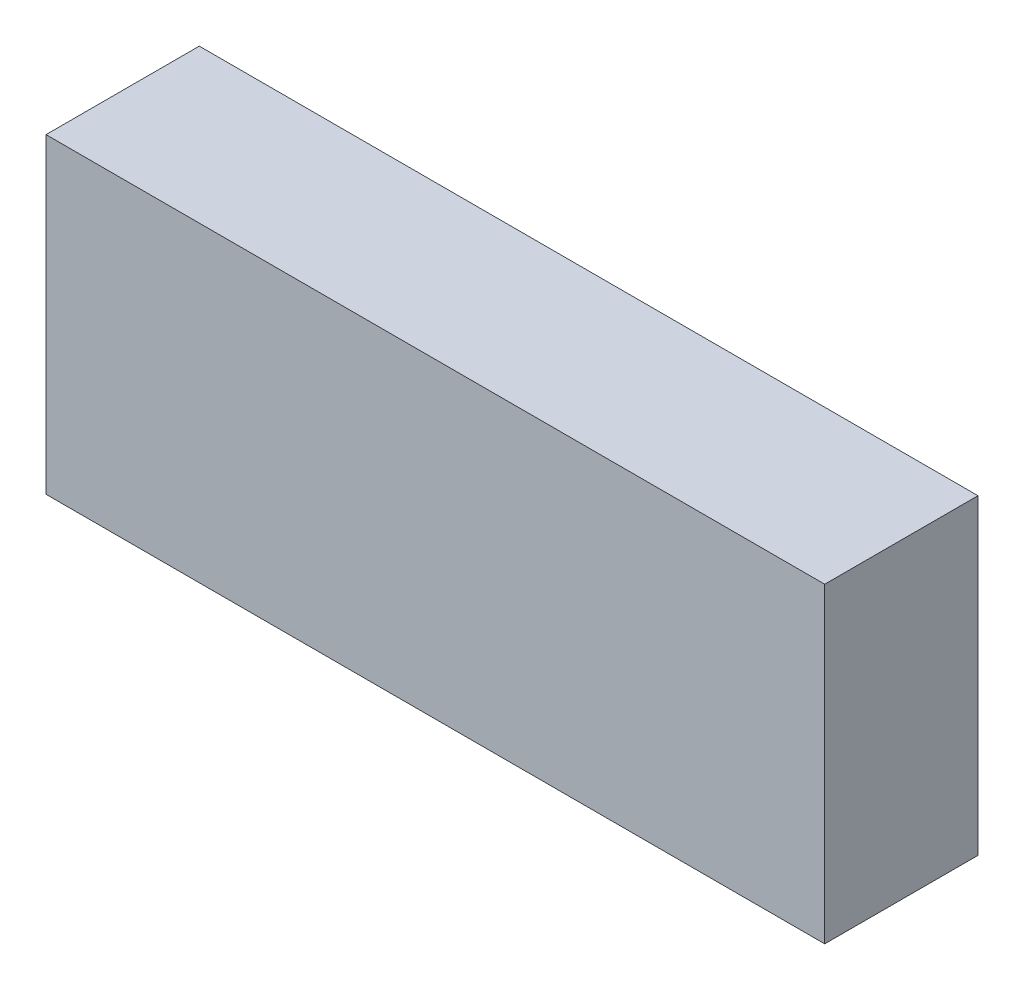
ISO-10303-21;
HEADER;
FILE_DESCRIPTION(('STEP AP214'),'2;1');
FILE_NAME('part.step','',(''),(''),'','','');
FILE_SCHEMA(('AUTOMOTIVE_DESIGN { 1 0 10303 214 1 1 1 1 }'));
ENDSEC;
DATA;
#1=APPLICATION_CONTEXT('core data for automotive mechanical design processes');
#2=APPLICATION_PROTOCOL_DEFINITION('international standard','automotive_design',2000,#1);
#3=PRODUCT_CONTEXT('',#1,'mechanical');
#4=PRODUCT('Part','Part','',(#3));
#5=PRODUCT_RELATED_PRODUCT_CATEGORY('part','',(#4));
#6=PRODUCT_DEFINITION_FORMATION('','',#4);
#7=PRODUCT_DEFINITION_CONTEXT('part definition',#1,'design');
#8=PRODUCT_DEFINITION('design','',#6,#7);
#9=PRODUCT_DEFINITION_SHAPE('','',#8);
#10=(LENGTH_UNIT() NAMED_UNIT(*) SI_UNIT(.MILLI.,.METRE.));
#11=(NAMED_UNIT(*) PLANE_ANGLE_UNIT() SI_UNIT($,.RADIAN.));
#12=(NAMED_UNIT(*) SI_UNIT($,.STERADIAN.) SOLID_ANGLE_UNIT());
#13=UNCERTAINTY_MEASURE_WITH_UNIT(LENGTH_MEASURE(1.E-05),#10,'distance_accuracy_value','');
#14=(GEOMETRIC_REPRESENTATION_CONTEXT(3) GLOBAL_UNCERTAINTY_ASSIGNED_CONTEXT((#13)) GLOBAL_UNIT_ASSIGNED_CONTEXT((#10,
#11,#12)) REPRESENTATION_CONTEXT('',''));
#15=CARTESIAN_POINT('',(0.,0.,0.));
#16=DIRECTION('',(0.,0.,1.));
#17=DIRECTION('',(1.,0.,0.));
#18=AXIS2_PLACEMENT_3D('',#15,#16,#17);
#19=CARTESIAN_POINT('',(0.,0.,0.499999));
#20=DIRECTION('',(0.,0.,1.));
#21=DIRECTION('',(1.,0.,0.));
#22=AXIS2_PLACEMENT_3D('',#19,#20,#21);
#23=PLANE('',#22);
#24=DIRECTION('',(-1.,0.,0.));
#25=VECTOR('',#24,1.);
#26=CARTESIAN_POINT('',(1.27,0.508,0.499999));
#27=LINE('',#26,#25);
#28=CARTESIAN_POINT('',(1.27,0.508,0.499999));
#29=VERTEX_POINT('',#28);
#30=CARTESIAN_POINT('',(-1.27,0.508,0.499999));
#31=VERTEX_POINT('',#30);
#32=EDGE_CURVE('E83',#29,#31,#27,.T.);
#33=ORIENTED_EDGE('',*,*,#32,.T.);
#34=DIRECTION('',(0.,-1.,0.));
#35=VECTOR('',#34,1.);
#36=CARTESIAN_POINT('',(-1.27,0.508,0.499999));
#37=LINE('',#36,#35);
#38=CARTESIAN_POINT('',(-1.27,-0.508,0.499999));
#39=VERTEX_POINT('',#38);
#40=EDGE_CURVE('E110',#31,#39,#37,.T.);
#41=ORIENTED_EDGE('',*,*,#40,.T.);
#42=DIRECTION('',(1.,0.,0.));
#43=VECTOR('',#42,1.);
#44=CARTESIAN_POINT('',(-1.27,-0.508,0.499999));
#45=LINE('',#44,#43);
#46=CARTESIAN_POINT('',(1.27,-0.508,0.499999));
#47=VERTEX_POINT('',#46);
#48=EDGE_CURVE('E75',#39,#47,#45,.T.);
#49=ORIENTED_EDGE('',*,*,#48,.T.);
#50=DIRECTION('',(0.,1.,0.));
#51=VECTOR('',#50,1.);
#52=CARTESIAN_POINT('',(1.27,-0.508,0.499999));
#53=LINE('',#52,#51);
#54=EDGE_CURVE('E11',#47,#29,#53,.T.);
#55=ORIENTED_EDGE('',*,*,#54,.T.);
#56=EDGE_LOOP('',(#33,#41,#49,#55));
#57=FACE_BOUND('',#56,.T.);
#58=ADVANCED_FACE('F17',(#57),#23,.T.);
#59=CARTESIAN_POINT('',(0.,0.,0.));
#60=DIRECTION('',(0.,0.,1.));
#61=DIRECTION('',(1.,0.,0.));
#62=AXIS2_PLACEMENT_3D('',#59,#60,#61);
#63=PLANE('',#62);
#64=DIRECTION('',(0.,1.,0.));
#65=VECTOR('',#64,1.);
#66=CARTESIAN_POINT('',(1.27,-0.508,0.));
#67=LINE('',#66,#65);
#68=CARTESIAN_POINT('',(1.27,-0.508,0.));
#69=VERTEX_POINT('',#68);
#70=CARTESIAN_POINT('',(1.27,0.508,0.));
#71=VERTEX_POINT('',#70);
#72=EDGE_CURVE('E26',#69,#71,#67,.T.);
#73=ORIENTED_EDGE('',*,*,#72,.F.);
#74=DIRECTION('',(1.,0.,0.));
#75=VECTOR('',#74,1.);
#76=CARTESIAN_POINT('',(-1.27,-0.508,0.));
#77=LINE('',#76,#75);
#78=CARTESIAN_POINT('',(-1.27,-0.508,0.));
#79=VERTEX_POINT('',#78);
#80=EDGE_CURVE('E100',#79,#69,#77,.T.);
#81=ORIENTED_EDGE('',*,*,#80,.F.);
#82=DIRECTION('',(0.,-1.,0.));
#83=VECTOR('',#82,1.);
#84=CARTESIAN_POINT('',(-1.27,0.508,0.));
#85=LINE('',#84,#83);
#86=CARTESIAN_POINT('',(-1.27,0.508,0.));
#87=VERTEX_POINT('',#86);
#88=EDGE_CURVE('E85',#87,#79,#85,.T.);
#89=ORIENTED_EDGE('',*,*,#88,.F.);
#90=DIRECTION('',(-1.,0.,0.));
#91=VECTOR('',#90,1.);
#92=CARTESIAN_POINT('',(1.27,0.508,0.));
#93=LINE('',#92,#91);
#94=EDGE_CURVE('E81',#71,#87,#93,.T.);
#95=ORIENTED_EDGE('',*,*,#94,.F.);
#96=EDGE_LOOP('',(#73,#81,#89,#95));
#97=FACE_BOUND('',#96,.T.);
#98=ADVANCED_FACE('F87',(#97),#63,.F.);
#99=CARTESIAN_POINT('',(1.27,-0.508,0.));
#100=DIRECTION('',(-1.,0.,0.));
#101=DIRECTION('',(0.,0.,1.));
#102=AXIS2_PLACEMENT_3D('',#99,#100,#101);
#103=PLANE('',#102);
#104=ORIENTED_EDGE('',*,*,#72,.T.);
#105=DIRECTION('',(0.,0.,1.));
#106=VECTOR('',#105,1.);
#107=CARTESIAN_POINT('',(1.27,0.508,0.));
#108=LINE('',#107,#106);
#109=EDGE_CURVE('E70',#71,#29,#108,.T.);
#110=ORIENTED_EDGE('',*,*,#109,.T.);
#111=ORIENTED_EDGE('',*,*,#54,.F.);
#112=DIRECTION('',(0.,0.,1.));
#113=VECTOR('',#112,1.);
#114=CARTESIAN_POINT('',(1.27,-0.508,0.));
#115=LINE('',#114,#113);
#116=EDGE_CURVE('E20',#69,#47,#115,.T.);
#117=ORIENTED_EDGE('',*,*,#116,.F.);
#118=EDGE_LOOP('',(#104,#110,#111,#117));
#119=FACE_BOUND('',#118,.T.);
#120=ADVANCED_FACE('F69',(#119),#103,.F.);
#121=CARTESIAN_POINT('',(-1.27,-0.508,0.));
#122=DIRECTION('',(0.,1.,0.));
#123=DIRECTION('',(1.,0.,0.));
#124=AXIS2_PLACEMENT_3D('',#121,#122,#123);
#125=PLANE('',#124);
#126=ORIENTED_EDGE('',*,*,#80,.T.);
#127=ORIENTED_EDGE('',*,*,#116,.T.);
#128=ORIENTED_EDGE('',*,*,#48,.F.);
#129=DIRECTION('',(0.,0.,1.));
#130=VECTOR('',#129,1.);
#131=CARTESIAN_POINT('',(-1.27,-0.508,0.));
#132=LINE('',#131,#130);
#133=EDGE_CURVE('E107',#79,#39,#132,.T.);
#134=ORIENTED_EDGE('',*,*,#133,.F.);
#135=EDGE_LOOP('',(#126,#127,#128,#134));
#136=FACE_BOUND('',#135,.T.);
#137=ADVANCED_FACE('F124',(#136),#125,.F.);
#138=CARTESIAN_POINT('',(-1.27,0.508,0.));
#139=DIRECTION('',(1.,0.,0.));
#140=DIRECTION('',(0.,1.,0.));
#141=AXIS2_PLACEMENT_3D('',#138,#139,#140);
#142=PLANE('',#141);
#143=ORIENTED_EDGE('',*,*,#88,.T.);
#144=ORIENTED_EDGE('',*,*,#133,.T.);
#145=ORIENTED_EDGE('',*,*,#40,.F.);
#146=DIRECTION('',(0.,0.,1.));
#147=VECTOR('',#146,1.);
#148=CARTESIAN_POINT('',(-1.27,0.508,0.));
#149=LINE('',#148,#147);
#150=EDGE_CURVE('E91',#87,#31,#149,.T.);
#151=ORIENTED_EDGE('',*,*,#150,.F.);
#152=EDGE_LOOP('',(#143,#144,#145,#151));
#153=FACE_BOUND('',#152,.T.);
#154=ADVANCED_FACE('F126',(#153),#142,.F.);
#155=CARTESIAN_POINT('',(1.27,0.508,0.));
#156=DIRECTION('',(0.,-1.,0.));
#157=DIRECTION('',(0.,0.,-1.));
#158=AXIS2_PLACEMENT_3D('',#155,#156,#157);
#159=PLANE('',#158);
#160=ORIENTED_EDGE('',*,*,#94,.T.);
#161=ORIENTED_EDGE('',*,*,#150,.T.);
#162=ORIENTED_EDGE('',*,*,#32,.F.);
#163=ORIENTED_EDGE('',*,*,#109,.F.);
#164=EDGE_LOOP('',(#160,#161,#162,#163));
#165=FACE_BOUND('',#164,.T.);
#166=ADVANCED_FACE('F79',(#165),#159,.F.);
#167=CLOSED_SHELL('',(#58,#98,#120,#137,#154,#166));
#168=MANIFOLD_SOLID_BREP('B1',#167);
#169=ADVANCED_BREP_SHAPE_REPRESENTATION('',(#18,#168),#14);
#170=SHAPE_DEFINITION_REPRESENTATION(#9,#169);
ENDSEC;
END-ISO-10303-21;
